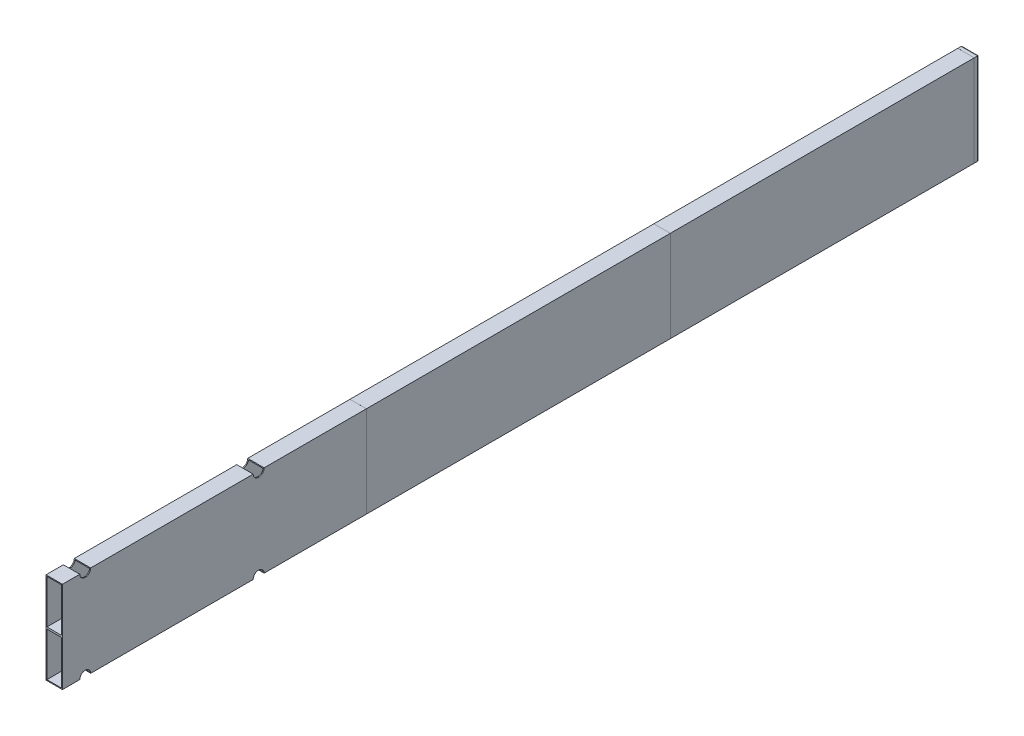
from build123d import *

# Parameters (mm, degrees)
ESQUISSE1_W             = 18
ESQUISSE1_H             = 100
ESQUISSE1_W_2           = 16
ESQUISSE1_H_2           = 48
BASE_EXTRUSION_DEPTH    = 333
ESQUISSE4_R             = 6
ENL_V_MAT_EXTRU_1_DEPTH = 349.156573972
ESQUISSE7_W             = 18.02
ESQUISSE7_H             = 100.02
ESQUISSE7_W_2           = 16
ESQUISSE7_H_2           = 48
BOSS_EXTRU_1_DEPTH      = 333
ESQUISSE8_W             = 18
ESQUISSE8_H             = 100
ESQUISSE8_W_2           = 16
ESQUISSE8_H_2           = 48
BOSS_EXTRU_2_DEPTH      = 333
ESQUISSE9_W             = 18.02
ESQUISSE9_H             = 100.02
BOSS_EXTRU_3_DEPTH      = 5
CONG_1_R                = 1.5


with BuildPart() as part:
    # Esquisse1 → Base-Extrusion (new body)
    with BuildSketch(Plane.XY):
        with Locations((0, 50)):
            Rectangle(ESQUISSE1_W, ESQUISSE1_H)
        with Locations((0, 25)):
            Rectangle(ESQUISSE1_W_2, ESQUISSE1_H_2, mode=Mode.SUBTRACT)
        with Locations((0, 75)):
            Rectangle(ESQUISSE1_W_2, ESQUISSE1_H_2, mode=Mode.SUBTRACT)
    extrude(amount=-BASE_EXTRUSION_DEPTH)

    # Esquisse4 → Enl_v. mat.-Extru.1 (cut, through all)
    with BuildSketch(Plane(origin=(9, 0, 0), x_dir=(0, 0, -1), z_dir=(1, 0, 0))):
        with Locations((25, 100)):
            Circle(ESQUISSE4_R)
        with Locations((215, 100)):
            Circle(ESQUISSE4_R)
        with Locations((25, 0)):
            Circle(ESQUISSE4_R)
        with Locations((215, 0)):
            Circle(ESQUISSE4_R)
    extrude(amount=-ENL_V_MAT_EXTRU_1_DEPTH, mode=Mode.SUBTRACT)

    # Esquisse7 → Boss.-Extru.1 (add)
    with BuildSketch(Plane(origin=(0, 0, -333), x_dir=(-1, 0, 0), z_dir=(0, 0, -1))):
        with Locations((0, 50)):
            Rectangle(ESQUISSE7_W, ESQUISSE7_H)
        with Locations((0, 25)):
            Rectangle(ESQUISSE7_W_2, ESQUISSE7_H_2, mode=Mode.SUBTRACT)
        with Locations((0, 75)):
            Rectangle(ESQUISSE7_W_2, ESQUISSE7_H_2, mode=Mode.SUBTRACT)
    extrude(amount=BOSS_EXTRU_1_DEPTH)

    # Esquisse8 → Boss.-Extru.2 (add)
    with BuildSketch(Plane(origin=(0, 0, -666), x_dir=(-1, 0, 0), z_dir=(0, 0, -1))):
        with Locations((0, 50)):
            Rectangle(ESQUISSE8_W, ESQUISSE8_H)
        with Locations((0, 25)):
            Rectangle(ESQUISSE8_W_2, ESQUISSE8_H_2, mode=Mode.SUBTRACT)
        with Locations((0, 75)):
            Rectangle(ESQUISSE8_W_2, ESQUISSE8_H_2, mode=Mode.SUBTRACT)
    extrude(amount=BOSS_EXTRU_2_DEPTH)

    # Esquisse9 → Boss.-Extru.3 (add)
    with BuildSketch(Plane(origin=(0, 0, -999), x_dir=(-1, 0, 0), z_dir=(0, 0, -1))):
        with Locations((0, 50)):
            Rectangle(ESQUISSE9_W, ESQUISSE9_H)
    extrude(amount=BOSS_EXTRU_3_DEPTH)

    # Cong_1
    cong_1_edges = [part.edges().sort_by_distance(p)[0] for p in [
        (0, 100.01, -1004),
        (9.01, 50, -1004),
        (-9.01, 50, -1004),
        (0, -0.01, -1004),
    ]]
    fillet(cong_1_edges, radius=CONG_1_R)


solid = part.part
